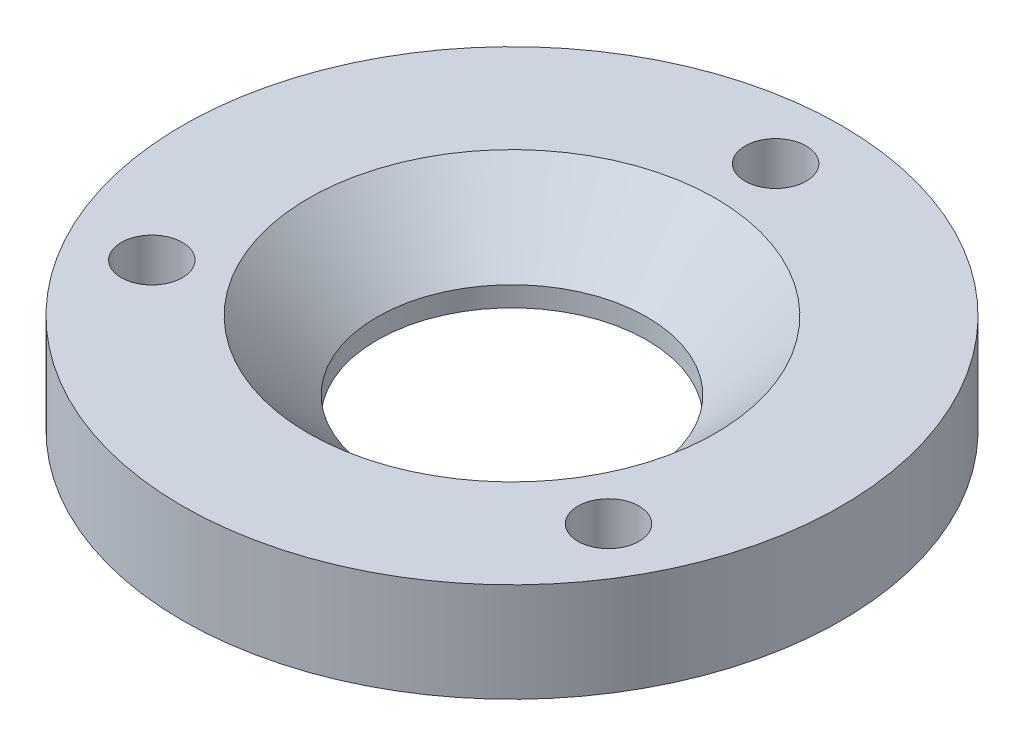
ISO-10303-21;
HEADER;
FILE_DESCRIPTION(('STEP AP214'),'2;1');
FILE_NAME('part.step','',(''),(''),'','','');
FILE_SCHEMA(('AUTOMOTIVE_DESIGN { 1 0 10303 214 1 1 1 1 }'));
ENDSEC;
DATA;
#1=APPLICATION_CONTEXT('core data for automotive mechanical design processes');
#2=APPLICATION_PROTOCOL_DEFINITION('international standard','automotive_design',2000,#1);
#3=PRODUCT_CONTEXT('',#1,'mechanical');
#4=PRODUCT('Part','Part','',(#3));
#5=PRODUCT_RELATED_PRODUCT_CATEGORY('part','',(#4));
#6=PRODUCT_DEFINITION_FORMATION('','',#4);
#7=PRODUCT_DEFINITION_CONTEXT('part definition',#1,'design');
#8=PRODUCT_DEFINITION('design','',#6,#7);
#9=PRODUCT_DEFINITION_SHAPE('','',#8);
#10=(LENGTH_UNIT() NAMED_UNIT(*) SI_UNIT(.MILLI.,.METRE.));
#11=(NAMED_UNIT(*) PLANE_ANGLE_UNIT() SI_UNIT($,.RADIAN.));
#12=(NAMED_UNIT(*) SI_UNIT($,.STERADIAN.) SOLID_ANGLE_UNIT());
#13=UNCERTAINTY_MEASURE_WITH_UNIT(LENGTH_MEASURE(1.E-05),#10,'distance_accuracy_value','');
#14=(GEOMETRIC_REPRESENTATION_CONTEXT(3) GLOBAL_UNCERTAINTY_ASSIGNED_CONTEXT((#13)) GLOBAL_UNIT_ASSIGNED_CONTEXT((#10,
#11,#12)) REPRESENTATION_CONTEXT('',''));
#15=CARTESIAN_POINT('',(0.,0.,0.));
#16=DIRECTION('',(0.,0.,1.));
#17=DIRECTION('',(1.,0.,0.));
#18=AXIS2_PLACEMENT_3D('',#15,#16,#17);
#19=CARTESIAN_POINT('',(0.,-3.30200000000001,0.));
#20=DIRECTION('',(0.,1.,0.));
#21=DIRECTION('',(0.,0.,1.));
#22=AXIS2_PLACEMENT_3D('',#19,#20,#21);
#23=CONICAL_SURFACE('',#22,6.5024,0.785398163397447);
#24=CARTESIAN_POINT('',(0.,0.,0.));
#25=DIRECTION('',(0.,1.,0.));
#26=DIRECTION('',(0.,0.,1.));
#27=AXIS2_PLACEMENT_3D('',#24,#25,#26);
#28=CIRCLE('',#27,9.8044);
#29=CARTESIAN_POINT('',(0.,0.,9.8044));
#30=VERTEX_POINT('',#29);
#31=EDGE_CURVE('E10',#30,#30,#28,.T.);
#32=ORIENTED_EDGE('',*,*,#31,.T.);
#33=EDGE_LOOP('',(#32));
#34=FACE_BOUND('',#33,.T.);
#35=CARTESIAN_POINT('',(0.,-3.30200000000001,0.));
#36=DIRECTION('',(0.,1.,0.));
#37=DIRECTION('',(0.,0.,1.));
#38=AXIS2_PLACEMENT_3D('',#35,#36,#37);
#39=CIRCLE('',#38,6.5024);
#40=CARTESIAN_POINT('',(0.,-3.30200000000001,6.5024));
#41=VERTEX_POINT('',#40);
#42=EDGE_CURVE('E57',#41,#41,#39,.T.);
#43=ORIENTED_EDGE('',*,*,#42,.F.);
#44=EDGE_LOOP('',(#43));
#45=FACE_BOUND('',#44,.T.);
#46=ADVANCED_FACE('F32',(#34,#45),#23,.F.);
#47=CARTESIAN_POINT('',(0.,0.,9.8044));
#48=DIRECTION('',(0.,1.,0.));
#49=DIRECTION('',(0.,0.,1.));
#50=AXIS2_PLACEMENT_3D('',#47,#48,#49);
#51=PLANE('',#50);
#52=CARTESIAN_POINT('',(-10.9985226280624,0.,6.3499999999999));
#53=DIRECTION('',(0.,1.,0.));
#54=DIRECTION('',(0.866025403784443,0.,-0.499999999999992));
#55=AXIS2_PLACEMENT_3D('',#52,#53,#54);
#56=CIRCLE('',#55,1.4732);
#57=CARTESIAN_POINT('',(-9.72269400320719,0.,5.61339999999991));
#58=VERTEX_POINT('',#57);
#59=EDGE_CURVE('E75',#58,#58,#56,.T.);
#60=ORIENTED_EDGE('',*,*,#59,.F.);
#61=EDGE_LOOP('',(#60));
#62=FACE_BOUND('',#61,.T.);
#63=CARTESIAN_POINT('',(10.9985226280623,0.,6.35000000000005));
#64=DIRECTION('',(0.,1.,0.));
#65=DIRECTION('',(-0.866025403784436,0.,-0.500000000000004));
#66=AXIS2_PLACEMENT_3D('',#63,#64,#65);
#67=CIRCLE('',#66,1.4732);
#68=CARTESIAN_POINT('',(9.72269400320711,0.,5.61340000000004));
#69=VERTEX_POINT('',#68);
#70=EDGE_CURVE('E69',#69,#69,#67,.T.);
#71=ORIENTED_EDGE('',*,*,#70,.F.);
#72=EDGE_LOOP('',(#71));
#73=FACE_BOUND('',#72,.T.);
#74=CARTESIAN_POINT('',(0.,0.,-12.7));
#75=DIRECTION('',(0.,1.,0.));
#76=DIRECTION('',(0.,0.,1.));
#77=AXIS2_PLACEMENT_3D('',#74,#75,#76);
#78=CIRCLE('',#77,1.4732);
#79=CARTESIAN_POINT('',(0.,0.,-11.2268));
#80=VERTEX_POINT('',#79);
#81=EDGE_CURVE('E63',#80,#80,#78,.T.);
#82=ORIENTED_EDGE('',*,*,#81,.F.);
#83=EDGE_LOOP('',(#82));
#84=FACE_BOUND('',#83,.T.);
#85=CARTESIAN_POINT('',(0.,0.,0.));
#86=DIRECTION('',(0.,1.,0.));
#87=DIRECTION('',(0.,0.,1.));
#88=AXIS2_PLACEMENT_3D('',#85,#86,#87);
#89=CIRCLE('',#88,15.875);
#90=CARTESIAN_POINT('',(0.,0.,15.875));
#91=VERTEX_POINT('',#90);
#92=EDGE_CURVE('E38',#91,#91,#89,.T.);
#93=ORIENTED_EDGE('',*,*,#92,.T.);
#94=EDGE_LOOP('',(#93));
#95=FACE_BOUND('',#94,.T.);
#96=ORIENTED_EDGE('',*,*,#31,.F.);
#97=EDGE_LOOP('',(#96));
#98=FACE_BOUND('',#97,.T.);
#99=ADVANCED_FACE('F81',(#62,#73,#84,#95,#98),#51,.T.);
#100=CARTESIAN_POINT('',(0.,13.9108050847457,0.));
#101=DIRECTION('',(0.,1.,0.));
#102=DIRECTION('',(0.,0.,1.));
#103=AXIS2_PLACEMENT_3D('',#100,#101,#102);
#104=CYLINDRICAL_SURFACE('',#103,15.875);
#105=CARTESIAN_POINT('',(0.,-4.77520000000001,0.));
#106=DIRECTION('',(0.,1.,0.));
#107=DIRECTION('',(0.,0.,1.));
#108=AXIS2_PLACEMENT_3D('',#105,#106,#107);
#109=CIRCLE('',#108,15.875);
#110=CARTESIAN_POINT('',(0.,-4.77520000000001,15.875));
#111=VERTEX_POINT('',#110);
#112=EDGE_CURVE('E42',#111,#111,#109,.T.);
#113=ORIENTED_EDGE('',*,*,#112,.T.);
#114=EDGE_LOOP('',(#113));
#115=FACE_BOUND('',#114,.T.);
#116=ORIENTED_EDGE('',*,*,#92,.F.);
#117=EDGE_LOOP('',(#116));
#118=FACE_BOUND('',#117,.T.);
#119=ADVANCED_FACE('F84',(#115,#118),#104,.T.);
#120=CARTESIAN_POINT('',(0.,-4.77520000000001,15.875));
#121=DIRECTION('',(0.,-1.,0.));
#122=DIRECTION('',(0.,0.,-1.));
#123=AXIS2_PLACEMENT_3D('',#120,#121,#122);
#124=PLANE('',#123);
#125=CARTESIAN_POINT('',(-10.9985226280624,-4.77520000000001,6.3499999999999));
#126=DIRECTION('',(0.,1.,0.));
#127=DIRECTION('',(0.866025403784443,0.,-0.499999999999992));
#128=AXIS2_PLACEMENT_3D('',#125,#126,#127);
#129=CIRCLE('',#128,1.4732);
#130=CARTESIAN_POINT('',(-9.72269400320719,-4.77520000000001,5.61339999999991));
#131=VERTEX_POINT('',#130);
#132=EDGE_CURVE('E72',#131,#131,#129,.T.);
#133=ORIENTED_EDGE('',*,*,#132,.T.);
#134=EDGE_LOOP('',(#133));
#135=FACE_BOUND('',#134,.T.);
#136=CARTESIAN_POINT('',(10.9985226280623,-4.77520000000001,6.35000000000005));
#137=DIRECTION('',(0.,1.,0.));
#138=DIRECTION('',(-0.866025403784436,0.,-0.500000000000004));
#139=AXIS2_PLACEMENT_3D('',#136,#137,#138);
#140=CIRCLE('',#139,1.4732);
#141=CARTESIAN_POINT('',(9.72269400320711,-4.77520000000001,5.61340000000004));
#142=VERTEX_POINT('',#141);
#143=EDGE_CURVE('E66',#142,#142,#140,.T.);
#144=ORIENTED_EDGE('',*,*,#143,.T.);
#145=EDGE_LOOP('',(#144));
#146=FACE_BOUND('',#145,.T.);
#147=CARTESIAN_POINT('',(0.,-4.77520000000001,-12.7));
#148=DIRECTION('',(0.,1.,0.));
#149=DIRECTION('',(0.,0.,1.));
#150=AXIS2_PLACEMENT_3D('',#147,#148,#149);
#151=CIRCLE('',#150,1.4732);
#152=CARTESIAN_POINT('',(0.,-4.77520000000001,-11.2268));
#153=VERTEX_POINT('',#152);
#154=EDGE_CURVE('E60',#153,#153,#151,.T.);
#155=ORIENTED_EDGE('',*,*,#154,.T.);
#156=EDGE_LOOP('',(#155));
#157=FACE_BOUND('',#156,.T.);
#158=CARTESIAN_POINT('',(0.,-4.77520000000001,0.));
#159=DIRECTION('',(0.,1.,0.));
#160=DIRECTION('',(0.,0.,1.));
#161=AXIS2_PLACEMENT_3D('',#158,#159,#160);
#162=CIRCLE('',#161,10.16);
#163=CARTESIAN_POINT('',(0.,-4.77520000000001,10.16));
#164=VERTEX_POINT('',#163);
#165=EDGE_CURVE('E46',#164,#164,#162,.T.);
#166=ORIENTED_EDGE('',*,*,#165,.T.);
#167=EDGE_LOOP('',(#166));
#168=FACE_BOUND('',#167,.T.);
#169=ORIENTED_EDGE('',*,*,#112,.F.);
#170=EDGE_LOOP('',(#169));
#171=FACE_BOUND('',#170,.T.);
#172=ADVANCED_FACE('F122',(#135,#146,#157,#168,#171),#124,.T.);
#173=CARTESIAN_POINT('',(0.,13.9108050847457,0.));
#174=DIRECTION('',(0.,1.,0.));
#175=DIRECTION('',(0.,0.,1.));
#176=AXIS2_PLACEMENT_3D('',#173,#174,#175);
#177=CYLINDRICAL_SURFACE('',#176,10.16);
#178=CARTESIAN_POINT('',(0.,-4.26720000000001,0.));
#179=DIRECTION('',(0.,1.,0.));
#180=DIRECTION('',(0.,0.,1.));
#181=AXIS2_PLACEMENT_3D('',#178,#179,#180);
#182=CIRCLE('',#181,10.16);
#183=CARTESIAN_POINT('',(0.,-4.26720000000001,10.16));
#184=VERTEX_POINT('',#183);
#185=EDGE_CURVE('E51',#184,#184,#182,.T.);
#186=ORIENTED_EDGE('',*,*,#185,.T.);
#187=EDGE_LOOP('',(#186));
#188=FACE_BOUND('',#187,.T.);
#189=ORIENTED_EDGE('',*,*,#165,.F.);
#190=EDGE_LOOP('',(#189));
#191=FACE_BOUND('',#190,.T.);
#192=ADVANCED_FACE('F116',(#188,#191),#177,.F.);
#193=CARTESIAN_POINT('',(0.,-4.26720000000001,10.16));
#194=DIRECTION('',(0.,-1.,0.));
#195=DIRECTION('',(0.,0.,-1.));
#196=AXIS2_PLACEMENT_3D('',#193,#194,#195);
#197=PLANE('',#196);
#198=CARTESIAN_POINT('',(0.,-4.26720000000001,0.));
#199=DIRECTION('',(0.,1.,0.));
#200=DIRECTION('',(0.,0.,1.));
#201=AXIS2_PLACEMENT_3D('',#198,#199,#200);
#202=CIRCLE('',#201,6.5024);
#203=CARTESIAN_POINT('',(0.,-4.26720000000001,6.5024));
#204=VERTEX_POINT('',#203);
#205=EDGE_CURVE('E54',#204,#204,#202,.T.);
#206=ORIENTED_EDGE('',*,*,#205,.T.);
#207=EDGE_LOOP('',(#206));
#208=FACE_BOUND('',#207,.T.);
#209=ORIENTED_EDGE('',*,*,#185,.F.);
#210=EDGE_LOOP('',(#209));
#211=FACE_BOUND('',#210,.T.);
#212=ADVANCED_FACE('F102',(#208,#211),#197,.T.);
#213=CARTESIAN_POINT('',(0.,13.9108050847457,0.));
#214=DIRECTION('',(0.,1.,0.));
#215=DIRECTION('',(0.,0.,1.));
#216=AXIS2_PLACEMENT_3D('',#213,#214,#215);
#217=CYLINDRICAL_SURFACE('',#216,6.5024);
#218=ORIENTED_EDGE('',*,*,#42,.T.);
#219=EDGE_LOOP('',(#218));
#220=FACE_BOUND('',#219,.T.);
#221=ORIENTED_EDGE('',*,*,#205,.F.);
#222=EDGE_LOOP('',(#221));
#223=FACE_BOUND('',#222,.T.);
#224=ADVANCED_FACE('F93',(#220,#223),#217,.F.);
#225=CARTESIAN_POINT('',(0.,-4.77520000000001,-12.7));
#226=DIRECTION('',(0.,1.,0.));
#227=DIRECTION('',(0.,0.,1.));
#228=AXIS2_PLACEMENT_3D('',#225,#226,#227);
#229=CYLINDRICAL_SURFACE('',#228,1.4732);
#230=ORIENTED_EDGE('',*,*,#154,.F.);
#231=EDGE_LOOP('',(#230));
#232=FACE_BOUND('',#231,.T.);
#233=ORIENTED_EDGE('',*,*,#81,.T.);
#234=EDGE_LOOP('',(#233));
#235=FACE_BOUND('',#234,.T.);
#236=ADVANCED_FACE('F90',(#232,#235),#229,.F.);
#237=CARTESIAN_POINT('',(10.9985226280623,-4.77520000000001,6.35000000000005));
#238=DIRECTION('',(0.,1.,0.));
#239=DIRECTION('',(0.,0.,1.));
#240=AXIS2_PLACEMENT_3D('',#237,#238,#239);
#241=CYLINDRICAL_SURFACE('',#240,1.4732);
#242=ORIENTED_EDGE('',*,*,#143,.F.);
#243=EDGE_LOOP('',(#242));
#244=FACE_BOUND('',#243,.T.);
#245=ORIENTED_EDGE('',*,*,#70,.T.);
#246=EDGE_LOOP('',(#245));
#247=FACE_BOUND('',#246,.T.);
#248=ADVANCED_FACE('F92',(#244,#247),#241,.F.);
#249=CARTESIAN_POINT('',(-10.9985226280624,-4.77520000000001,6.3499999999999));
#250=DIRECTION('',(0.,1.,0.));
#251=DIRECTION('',(0.,0.,1.));
#252=AXIS2_PLACEMENT_3D('',#249,#250,#251);
#253=CYLINDRICAL_SURFACE('',#252,1.4732);
#254=ORIENTED_EDGE('',*,*,#132,.F.);
#255=EDGE_LOOP('',(#254));
#256=FACE_BOUND('',#255,.T.);
#257=ORIENTED_EDGE('',*,*,#59,.T.);
#258=EDGE_LOOP('',(#257));
#259=FACE_BOUND('',#258,.T.);
#260=ADVANCED_FACE('F79',(#256,#259),#253,.F.);
#261=CLOSED_SHELL('',(#46,#99,#119,#172,#192,#212,#224,#236,#248,#260));
#262=MANIFOLD_SOLID_BREP('B2',#261);
#263=ADVANCED_BREP_SHAPE_REPRESENTATION('',(#18,#262),#14);
#264=SHAPE_DEFINITION_REPRESENTATION(#9,#263);
ENDSEC;
END-ISO-10303-21;
